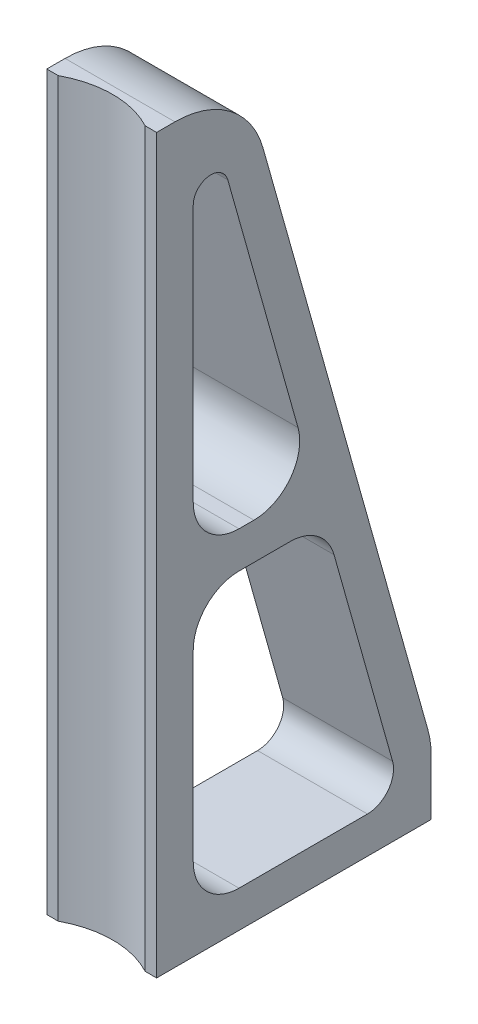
from build123d import *

# Parameters (mm, degrees)
BOSS_EXTRUDE1_DEPTH = 3.81
SKETCH4_R           = 6.35
CUT_EXTRUDE2_DEPTH  = 55.388037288
CUT_EXTRUDE3_DEPTH  = 55.78692271
FILLET1_R           = 3.175


with BuildPart() as part:
    # Sketch2 → Boss-Extrude1 (new, symmetric)
    with BuildSketch(Plane(origin=(0, 0, 0), x_dir=(0, 0, -1), z_dir=(1, 0, 0))):
        with BuildLine():
            Line((0, 0), (0, 50.8))
            Line((0, 50.8), (1.27, 50.8))
            ThreePointArc((1.27, 50.8), (5.104407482, 49.51160244), (7.38283347, 46.169234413))
            Line((7.38283347, 46.169234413), (18.81283347, 5.529234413))
            ThreePointArc((18.81283347, 5.529234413), (18.990428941, 4.677757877), (19.05, 3.81))
            Line((19.05, 3.81), (19.05, 0))
            Line((19.05, 0), (0, 0))
        make_face()
    extrude(amount=BOSS_EXTRUDE1_DEPTH, both=True)

    # Sketch4 → Cut-Extrude2 (cut, through all)
    with BuildSketch(Plane(origin=(0, 50.8, 0), x_dir=(1, 0, 0), z_dir=(0, 1, 0))):
        with Locations((0, -5.588)):
            Circle(SKETCH4_R)
    extrude(amount=-CUT_EXTRUDE2_DEPTH, mode=Mode.SUBTRACT)

    # Sketch5 → Cut-Extrude3 (cut, through all)
    with BuildSketch(Plane(origin=(3.81, 0, 0), x_dir=(0, 0, -1), z_dir=(1, 0, 0))):
        with BuildLine():
            Line((2.54, 21.59), (2.54, 2.54))
            Line((2.54, 2.54), (14.62417226, 2.54))
            ThreePointArc((14.62417226, 2.54), (16.067863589, 3.257507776), (16.367700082, 4.841540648))
            Line((16.367700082, 4.841540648), (11.657195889, 21.59))
            Line((11.657195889, 21.59), (2.54, 21.59))
        make_face()
        with BuildLine():
            Line((10.942820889, 24.13), (4.937700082, 45.481540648))
            ThreePointArc((4.937700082, 45.481540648), (3.594717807, 46.360983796), (2.54, 45.150780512))
            Line((2.54, 45.150780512), (2.54, 24.13))
            Line((2.54, 24.13), (10.942820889, 24.13))
        make_face()
    extrude(amount=-CUT_EXTRUDE3_DEPTH, mode=Mode.SUBTRACT)

    # Fillet1
    fillet1_edges = [part.edges().sort_by_distance(p)[0] for p in [
        (0, 24.13, -2.54),
        (0, 24.13, -10.942820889),
        (0, 21.59, -2.54),
        (0, 21.59, -11.657195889),
        (0, 2.54, -2.54),
    ]]
    fillet(fillet1_edges, radius=FILLET1_R)


solid = part.part
